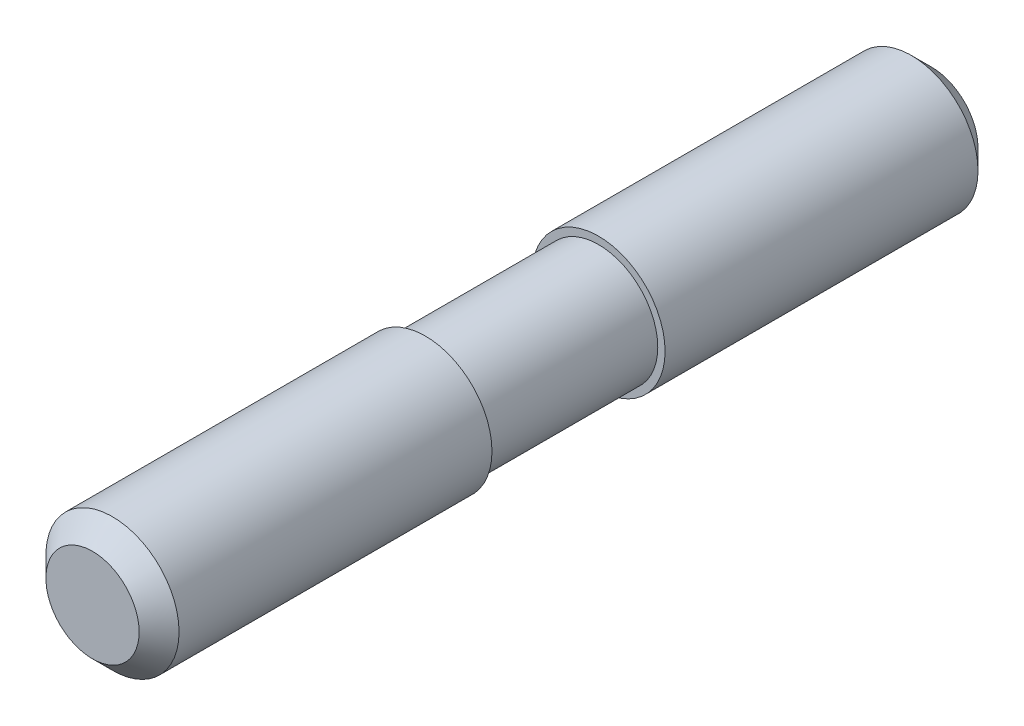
ISO-10303-21;
HEADER;
FILE_DESCRIPTION(('STEP AP214'),'2;1');
FILE_NAME('part.step','',(''),(''),'','','');
FILE_SCHEMA(('AUTOMOTIVE_DESIGN { 1 0 10303 214 1 1 1 1 }'));
ENDSEC;
DATA;
#1=APPLICATION_CONTEXT('core data for automotive mechanical design processes');
#2=APPLICATION_PROTOCOL_DEFINITION('international standard','automotive_design',2000,#1);
#3=PRODUCT_CONTEXT('',#1,'mechanical');
#4=PRODUCT('Part','Part','',(#3));
#5=PRODUCT_RELATED_PRODUCT_CATEGORY('part','',(#4));
#6=PRODUCT_DEFINITION_FORMATION('','',#4);
#7=PRODUCT_DEFINITION_CONTEXT('part definition',#1,'design');
#8=PRODUCT_DEFINITION('design','',#6,#7);
#9=PRODUCT_DEFINITION_SHAPE('','',#8);
#10=(LENGTH_UNIT() NAMED_UNIT(*) SI_UNIT(.MILLI.,.METRE.));
#11=(NAMED_UNIT(*) PLANE_ANGLE_UNIT() SI_UNIT($,.RADIAN.));
#12=(NAMED_UNIT(*) SI_UNIT($,.STERADIAN.) SOLID_ANGLE_UNIT());
#13=UNCERTAINTY_MEASURE_WITH_UNIT(LENGTH_MEASURE(1.E-05),#10,'distance_accuracy_value','');
#14=(GEOMETRIC_REPRESENTATION_CONTEXT(3) GLOBAL_UNCERTAINTY_ASSIGNED_CONTEXT((#13)) GLOBAL_UNIT_ASSIGNED_CONTEXT((#10,
#11,#12)) REPRESENTATION_CONTEXT('',''));
#15=CARTESIAN_POINT('',(0.,0.,0.));
#16=DIRECTION('',(0.,0.,1.));
#17=DIRECTION('',(1.,0.,0.));
#18=AXIS2_PLACEMENT_3D('',#15,#16,#17);
#19=CARTESIAN_POINT('',(0.,0.,0.));
#20=DIRECTION('',(0.,0.,1.));
#21=DIRECTION('',(1.,0.,0.));
#22=AXIS2_PLACEMENT_3D('',#19,#20,#21);
#23=PLANE('',#22);
#24=CARTESIAN_POINT('',(0.,0.,0.));
#25=DIRECTION('',(0.,0.,1.));
#26=DIRECTION('',(1.,0.,0.));
#27=AXIS2_PLACEMENT_3D('',#24,#25,#26);
#28=CIRCLE('',#27,3.5);
#29=CARTESIAN_POINT('',(3.5,0.,0.));
#30=VERTEX_POINT('',#29);
#31=EDGE_CURVE('E8',#30,#30,#28,.T.);
#32=ORIENTED_EDGE('',*,*,#31,.F.);
#33=EDGE_LOOP('',(#32));
#34=FACE_BOUND('',#33,.T.);
#35=ADVANCED_FACE('F12',(#34),#23,.F.);
#36=CARTESIAN_POINT('',(0.,0.,1.5));
#37=DIRECTION('',(0.,0.,1.));
#38=DIRECTION('',(1.,0.,0.));
#39=AXIS2_PLACEMENT_3D('',#36,#37,#38);
#40=CONICAL_SURFACE('',#39,5.,0.785398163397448);
#41=ORIENTED_EDGE('',*,*,#31,.T.);
#42=EDGE_LOOP('',(#41));
#43=FACE_BOUND('',#42,.T.);
#44=CARTESIAN_POINT('',(0.,0.,1.5));
#45=DIRECTION('',(0.,0.,1.));
#46=DIRECTION('',(1.,0.,0.));
#47=AXIS2_PLACEMENT_3D('',#44,#45,#46);
#48=CIRCLE('',#47,5.);
#49=CARTESIAN_POINT('',(5.,0.,1.5));
#50=VERTEX_POINT('',#49);
#51=EDGE_CURVE('E18',#50,#50,#48,.T.);
#52=ORIENTED_EDGE('',*,*,#51,.F.);
#53=EDGE_LOOP('',(#52));
#54=FACE_BOUND('',#53,.T.);
#55=ADVANCED_FACE('F61',(#43,#54),#40,.T.);
#56=CARTESIAN_POINT('',(0.,0.,70.));
#57=DIRECTION('',(0.,0.,1.));
#58=DIRECTION('',(1.,0.,0.));
#59=AXIS2_PLACEMENT_3D('',#56,#57,#58);
#60=CYLINDRICAL_SURFACE('',#59,5.);
#61=CARTESIAN_POINT('',(0.,0.,25.));
#62=DIRECTION('',(0.,0.,1.));
#63=DIRECTION('',(1.,0.,0.));
#64=AXIS2_PLACEMENT_3D('',#61,#62,#63);
#65=CIRCLE('',#64,5.);
#66=CARTESIAN_POINT('',(5.,0.,25.));
#67=VERTEX_POINT('',#66);
#68=EDGE_CURVE('E22',#67,#67,#65,.T.);
#69=ORIENTED_EDGE('',*,*,#68,.F.);
#70=EDGE_LOOP('',(#69));
#71=FACE_BOUND('',#70,.T.);
#72=ORIENTED_EDGE('',*,*,#51,.T.);
#73=EDGE_LOOP('',(#72));
#74=FACE_BOUND('',#73,.T.);
#75=ADVANCED_FACE('F66',(#71,#74),#60,.T.);
#76=CARTESIAN_POINT('',(5.,0.,25.));
#77=DIRECTION('',(0.,0.,-1.));
#78=DIRECTION('',(-1.,0.,0.));
#79=AXIS2_PLACEMENT_3D('',#76,#77,#78);
#80=PLANE('',#79);
#81=CARTESIAN_POINT('',(0.,0.,25.));
#82=DIRECTION('',(0.,0.,1.));
#83=DIRECTION('',(1.,0.,0.));
#84=AXIS2_PLACEMENT_3D('',#81,#82,#83);
#85=CIRCLE('',#84,4.45);
#86=CARTESIAN_POINT('',(4.45,0.,25.));
#87=VERTEX_POINT('',#86);
#88=EDGE_CURVE('E26',#87,#87,#85,.T.);
#89=ORIENTED_EDGE('',*,*,#88,.F.);
#90=EDGE_LOOP('',(#89));
#91=FACE_BOUND('',#90,.T.);
#92=ORIENTED_EDGE('',*,*,#68,.T.);
#93=EDGE_LOOP('',(#92));
#94=FACE_BOUND('',#93,.T.);
#95=ADVANCED_FACE('F70',(#91,#94),#80,.F.);
#96=CARTESIAN_POINT('',(0.,0.,70.));
#97=DIRECTION('',(0.,0.,1.));
#98=DIRECTION('',(1.,0.,0.));
#99=AXIS2_PLACEMENT_3D('',#96,#97,#98);
#100=CYLINDRICAL_SURFACE('',#99,4.45);
#101=CARTESIAN_POINT('',(0.,0.,38.));
#102=DIRECTION('',(0.,0.,1.));
#103=DIRECTION('',(1.,0.,0.));
#104=AXIS2_PLACEMENT_3D('',#101,#102,#103);
#105=CIRCLE('',#104,4.45);
#106=CARTESIAN_POINT('',(4.45,0.,38.));
#107=VERTEX_POINT('',#106);
#108=EDGE_CURVE('E31',#107,#107,#105,.T.);
#109=ORIENTED_EDGE('',*,*,#108,.F.);
#110=EDGE_LOOP('',(#109));
#111=FACE_BOUND('',#110,.T.);
#112=ORIENTED_EDGE('',*,*,#88,.T.);
#113=EDGE_LOOP('',(#112));
#114=FACE_BOUND('',#113,.T.);
#115=ADVANCED_FACE('F77',(#111,#114),#100,.T.);
#116=CARTESIAN_POINT('',(4.45,0.,38.));
#117=DIRECTION('',(0.,0.,1.));
#118=DIRECTION('',(1.,0.,0.));
#119=AXIS2_PLACEMENT_3D('',#116,#117,#118);
#120=PLANE('',#119);
#121=CARTESIAN_POINT('',(0.,0.,38.));
#122=DIRECTION('',(0.,0.,1.));
#123=DIRECTION('',(1.,0.,0.));
#124=AXIS2_PLACEMENT_3D('',#121,#122,#123);
#125=CIRCLE('',#124,5.);
#126=CARTESIAN_POINT('',(5.,0.,38.));
#127=VERTEX_POINT('',#126);
#128=EDGE_CURVE('E34',#127,#127,#125,.T.);
#129=ORIENTED_EDGE('',*,*,#128,.F.);
#130=EDGE_LOOP('',(#129));
#131=FACE_BOUND('',#130,.T.);
#132=ORIENTED_EDGE('',*,*,#108,.T.);
#133=EDGE_LOOP('',(#132));
#134=FACE_BOUND('',#133,.T.);
#135=ADVANCED_FACE('F57',(#131,#134),#120,.F.);
#136=CARTESIAN_POINT('',(0.,0.,70.));
#137=DIRECTION('',(0.,0.,1.));
#138=DIRECTION('',(1.,0.,0.));
#139=AXIS2_PLACEMENT_3D('',#136,#137,#138);
#140=CYLINDRICAL_SURFACE('',#139,5.);
#141=CARTESIAN_POINT('',(0.,0.,61.5));
#142=DIRECTION('',(0.,0.,1.));
#143=DIRECTION('',(1.,0.,0.));
#144=AXIS2_PLACEMENT_3D('',#141,#142,#143);
#145=CIRCLE('',#144,5.);
#146=CARTESIAN_POINT('',(5.,0.,61.5));
#147=VERTEX_POINT('',#146);
#148=EDGE_CURVE('E37',#147,#147,#145,.T.);
#149=ORIENTED_EDGE('',*,*,#148,.F.);
#150=EDGE_LOOP('',(#149));
#151=FACE_BOUND('',#150,.T.);
#152=ORIENTED_EDGE('',*,*,#128,.T.);
#153=EDGE_LOOP('',(#152));
#154=FACE_BOUND('',#153,.T.);
#155=ADVANCED_FACE('F48',(#151,#154),#140,.T.);
#156=CARTESIAN_POINT('',(0.,0.,63.));
#157=DIRECTION('',(0.,0.,-1.));
#158=DIRECTION('',(-1.,0.,0.));
#159=AXIS2_PLACEMENT_3D('',#156,#157,#158);
#160=CONICAL_SURFACE('',#159,3.5,0.785398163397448);
#161=ORIENTED_EDGE('',*,*,#148,.T.);
#162=EDGE_LOOP('',(#161));
#163=FACE_BOUND('',#162,.T.);
#164=CARTESIAN_POINT('',(0.,0.,63.));
#165=DIRECTION('',(0.,0.,1.));
#166=DIRECTION('',(1.,0.,0.));
#167=AXIS2_PLACEMENT_3D('',#164,#165,#166);
#168=CIRCLE('',#167,3.5);
#169=CARTESIAN_POINT('',(3.5,0.,63.));
#170=VERTEX_POINT('',#169);
#171=EDGE_CURVE('E40',#170,#170,#168,.T.);
#172=ORIENTED_EDGE('',*,*,#171,.F.);
#173=EDGE_LOOP('',(#172));
#174=FACE_BOUND('',#173,.T.);
#175=ADVANCED_FACE('F46',(#163,#174),#160,.T.);
#176=CARTESIAN_POINT('',(3.5,0.,63.));
#177=DIRECTION('',(0.,0.,-1.));
#178=DIRECTION('',(-1.,0.,0.));
#179=AXIS2_PLACEMENT_3D('',#176,#177,#178);
#180=PLANE('',#179);
#181=ORIENTED_EDGE('',*,*,#171,.T.);
#182=EDGE_LOOP('',(#181));
#183=FACE_BOUND('',#182,.T.);
#184=ADVANCED_FACE('F44',(#183),#180,.F.);
#185=CLOSED_SHELL('',(#35,#55,#75,#95,#115,#135,#155,#175,#184));
#186=MANIFOLD_SOLID_BREP('B1',#185);
#187=ADVANCED_BREP_SHAPE_REPRESENTATION('',(#18,#186),#14);
#188=SHAPE_DEFINITION_REPRESENTATION(#9,#187);
ENDSEC;
END-ISO-10303-21;
